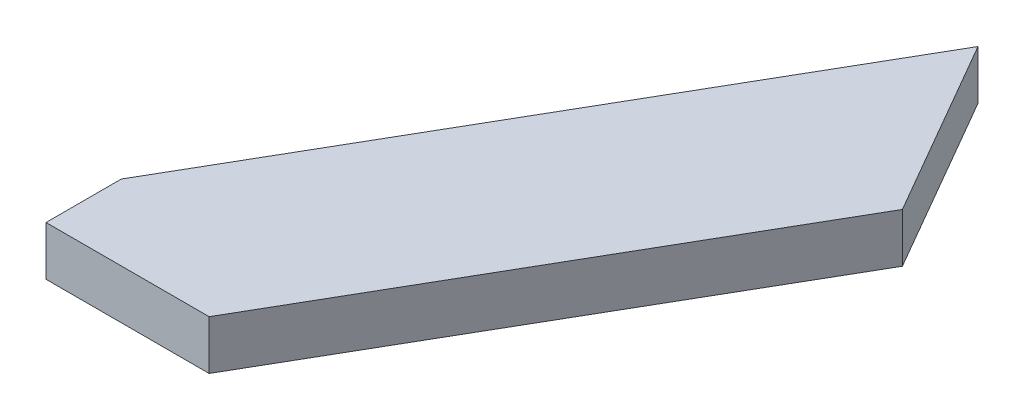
ISO-10303-21;
HEADER;
FILE_DESCRIPTION(('STEP AP214'),'2;1');
FILE_NAME('part.step','',(''),(''),'','','');
FILE_SCHEMA(('AUTOMOTIVE_DESIGN { 1 0 10303 214 1 1 1 1 }'));
ENDSEC;
DATA;
#1=APPLICATION_CONTEXT('core data for automotive mechanical design processes');
#2=APPLICATION_PROTOCOL_DEFINITION('international standard','automotive_design',2000,#1);
#3=PRODUCT_CONTEXT('',#1,'mechanical');
#4=PRODUCT('Part','Part','',(#3));
#5=PRODUCT_RELATED_PRODUCT_CATEGORY('part','',(#4));
#6=PRODUCT_DEFINITION_FORMATION('','',#4);
#7=PRODUCT_DEFINITION_CONTEXT('part definition',#1,'design');
#8=PRODUCT_DEFINITION('design','',#6,#7);
#9=PRODUCT_DEFINITION_SHAPE('','',#8);
#10=(LENGTH_UNIT() NAMED_UNIT(*) SI_UNIT(.MILLI.,.METRE.));
#11=(NAMED_UNIT(*) PLANE_ANGLE_UNIT() SI_UNIT($,.RADIAN.));
#12=(NAMED_UNIT(*) SI_UNIT($,.STERADIAN.) SOLID_ANGLE_UNIT());
#13=UNCERTAINTY_MEASURE_WITH_UNIT(LENGTH_MEASURE(1.E-05),#10,'distance_accuracy_value','');
#14=(GEOMETRIC_REPRESENTATION_CONTEXT(3) GLOBAL_UNCERTAINTY_ASSIGNED_CONTEXT((#13)) GLOBAL_UNIT_ASSIGNED_CONTEXT((#10,
#11,#12)) REPRESENTATION_CONTEXT('',''));
#15=CARTESIAN_POINT('',(0.,0.,0.));
#16=DIRECTION('',(0.,0.,1.));
#17=DIRECTION('',(1.,0.,0.));
#18=AXIS2_PLACEMENT_3D('',#15,#16,#17);
#19=CARTESIAN_POINT('',(-155.112278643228,17.4625,195.05795859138));
#20=DIRECTION('',(1.,0.,0.));
#21=DIRECTION('',(0.,0.,-1.));
#22=AXIS2_PLACEMENT_3D('',#19,#20,#21);
#23=PLANE('',#22);
#24=DIRECTION('',(0.,0.,1.));
#25=VECTOR('',#24,1.);
#26=CARTESIAN_POINT('',(-155.112278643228,-17.4625,195.05795859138));
#27=LINE('',#26,#25);
#28=CARTESIAN_POINT('',(-155.112278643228,-17.4625,141.662347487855));
#29=VERTEX_POINT('',#28);
#30=CARTESIAN_POINT('',(-155.112278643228,-17.4625,195.05795859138));
#31=VERTEX_POINT('',#30);
#32=EDGE_CURVE('E121',#29,#31,#27,.T.);
#33=ORIENTED_EDGE('',*,*,#32,.T.);
#34=DIRECTION('',(0.,-1.,0.));
#35=VECTOR('',#34,1.);
#36=CARTESIAN_POINT('',(-155.112278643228,17.4625,195.05795859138));
#37=LINE('',#36,#35);
#38=CARTESIAN_POINT('',(-155.112278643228,17.4625,195.05795859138));
#39=VERTEX_POINT('',#38);
#40=EDGE_CURVE('E11',#39,#31,#37,.T.);
#41=ORIENTED_EDGE('',*,*,#40,.F.);
#42=DIRECTION('',(0.,0.,1.));
#43=VECTOR('',#42,1.);
#44=CARTESIAN_POINT('',(-155.112278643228,17.4625,195.05795859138));
#45=LINE('',#44,#43);
#46=CARTESIAN_POINT('',(-155.112278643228,17.4625,141.662347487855));
#47=VERTEX_POINT('',#46);
#48=EDGE_CURVE('E139',#47,#39,#45,.T.);
#49=ORIENTED_EDGE('',*,*,#48,.F.);
#50=DIRECTION('',(0.,-1.,0.));
#51=VECTOR('',#50,1.);
#52=CARTESIAN_POINT('',(-155.112278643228,17.4625,141.662347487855));
#53=LINE('',#52,#51);
#54=EDGE_CURVE('E119',#47,#29,#53,.T.);
#55=ORIENTED_EDGE('',*,*,#54,.T.);
#56=EDGE_LOOP('',(#33,#41,#49,#55));
#57=FACE_BOUND('',#56,.T.);
#58=ADVANCED_FACE('F44',(#57),#23,.F.);
#59=CARTESIAN_POINT('',(-39.2932807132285,17.4625,195.05795859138));
#60=DIRECTION('',(0.,0.,-1.));
#61=DIRECTION('',(-1.,0.,0.));
#62=AXIS2_PLACEMENT_3D('',#59,#60,#61);
#63=PLANE('',#62);
#64=DIRECTION('',(1.,0.,0.));
#65=VECTOR('',#64,1.);
#66=CARTESIAN_POINT('',(-39.2932807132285,-17.4625,195.05795859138));
#67=LINE('',#66,#65);
#68=CARTESIAN_POINT('',(-39.2932807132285,-17.4625,195.05795859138));
#69=VERTEX_POINT('',#68);
#70=EDGE_CURVE('E129',#31,#69,#67,.T.);
#71=ORIENTED_EDGE('',*,*,#70,.T.);
#72=DIRECTION('',(0.,-1.,0.));
#73=VECTOR('',#72,1.);
#74=CARTESIAN_POINT('',(-39.2932807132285,17.4625,195.05795859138));
#75=LINE('',#74,#73);
#76=CARTESIAN_POINT('',(-39.2932807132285,17.4625,195.05795859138));
#77=VERTEX_POINT('',#76);
#78=EDGE_CURVE('E53',#77,#69,#75,.T.);
#79=ORIENTED_EDGE('',*,*,#78,.F.);
#80=DIRECTION('',(1.,0.,0.));
#81=VECTOR('',#80,1.);
#82=CARTESIAN_POINT('',(-39.2932807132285,17.4625,195.05795859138));
#83=LINE('',#82,#81);
#84=EDGE_CURVE('E98',#39,#77,#83,.T.);
#85=ORIENTED_EDGE('',*,*,#84,.F.);
#86=ORIENTED_EDGE('',*,*,#40,.T.);
#87=EDGE_LOOP('',(#71,#79,#85,#86));
#88=FACE_BOUND('',#87,.T.);
#89=ADVANCED_FACE('F160',(#88),#63,.F.);
#90=CARTESIAN_POINT('',(-39.2932807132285,17.4625,195.05795859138));
#91=DIRECTION('',(-0.866025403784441,0.,-0.499999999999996));
#92=DIRECTION('',(-0.499999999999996,0.,0.866025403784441));
#93=AXIS2_PLACEMENT_3D('',#90,#91,#92);
#94=PLANE('',#93);
#95=DIRECTION('',(0.499999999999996,0.,-0.866025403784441));
#96=VECTOR('',#95,1.);
#97=CARTESIAN_POINT('',(-39.2932807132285,-17.4625,195.05795859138));
#98=LINE('',#97,#96);
#99=CARTESIAN_POINT('',(140.832123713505,-17.4625,-116.928393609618));
#100=VERTEX_POINT('',#99);
#101=EDGE_CURVE('E115',#69,#100,#98,.T.);
#102=ORIENTED_EDGE('',*,*,#101,.T.);
#103=DIRECTION('',(0.,-1.,0.));
#104=VECTOR('',#103,1.);
#105=CARTESIAN_POINT('',(140.832123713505,17.4625,-116.928393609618));
#106=LINE('',#105,#104);
#107=CARTESIAN_POINT('',(140.832123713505,17.4625,-116.928393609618));
#108=VERTEX_POINT('',#107);
#109=EDGE_CURVE('E107',#108,#100,#106,.T.);
#110=ORIENTED_EDGE('',*,*,#109,.F.);
#111=DIRECTION('',(0.499999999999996,0.,-0.866025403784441));
#112=VECTOR('',#111,1.);
#113=CARTESIAN_POINT('',(-39.2932807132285,17.4625,195.05795859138));
#114=LINE('',#113,#112);
#115=EDGE_CURVE('E99',#77,#108,#114,.T.);
#116=ORIENTED_EDGE('',*,*,#115,.F.);
#117=ORIENTED_EDGE('',*,*,#78,.T.);
#118=EDGE_LOOP('',(#102,#110,#116,#117));
#119=FACE_BOUND('',#118,.T.);
#120=ADVANCED_FACE('F109',(#119),#94,.F.);
#121=CARTESIAN_POINT('',(67.5086384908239,17.4625,-243.928391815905));
#122=DIRECTION('',(-0.866025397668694,0.,0.50000001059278));
#123=DIRECTION('',(0.50000001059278,0.,0.866025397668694));
#124=AXIS2_PLACEMENT_3D('',#121,#122,#123);
#125=PLANE('',#124);
#126=DIRECTION('',(-0.50000001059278,0.,-0.866025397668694));
#127=VECTOR('',#126,1.);
#128=CARTESIAN_POINT('',(67.5086384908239,-17.4625,-243.928391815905));
#129=LINE('',#128,#127);
#130=CARTESIAN_POINT('',(67.5086384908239,-17.4625,-243.928391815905));
#131=VERTEX_POINT('',#130);
#132=EDGE_CURVE('E85',#100,#131,#129,.T.);
#133=ORIENTED_EDGE('',*,*,#132,.T.);
#134=DIRECTION('',(0.,-1.,0.));
#135=VECTOR('',#134,1.);
#136=CARTESIAN_POINT('',(67.5086384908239,17.4625,-243.928391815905));
#137=LINE('',#136,#135);
#138=CARTESIAN_POINT('',(67.5086384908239,17.4625,-243.928391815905));
#139=VERTEX_POINT('',#138);
#140=EDGE_CURVE('E112',#139,#131,#137,.T.);
#141=ORIENTED_EDGE('',*,*,#140,.F.);
#142=DIRECTION('',(-0.50000001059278,0.,-0.866025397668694));
#143=VECTOR('',#142,1.);
#144=CARTESIAN_POINT('',(67.5086384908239,17.4625,-243.928391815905));
#145=LINE('',#144,#143);
#146=EDGE_CURVE('E104',#108,#139,#145,.T.);
#147=ORIENTED_EDGE('',*,*,#146,.F.);
#148=ORIENTED_EDGE('',*,*,#109,.T.);
#149=EDGE_LOOP('',(#133,#141,#147,#148));
#150=FACE_BOUND('',#149,.T.);
#151=ADVANCED_FACE('F116',(#150),#125,.F.);
#152=CARTESIAN_POINT('',(-155.112278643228,17.4625,141.662347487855));
#153=DIRECTION('',(0.866025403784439,0.,0.5));
#154=DIRECTION('',(0.5,0.,-0.866025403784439));
#155=AXIS2_PLACEMENT_3D('',#152,#153,#154);
#156=PLANE('',#155);
#157=DIRECTION('',(-0.5,0.,0.866025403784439));
#158=VECTOR('',#157,1.);
#159=CARTESIAN_POINT('',(-155.112278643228,-17.4625,141.662347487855));
#160=LINE('',#159,#158);
#161=EDGE_CURVE('E86',#131,#29,#160,.T.);
#162=ORIENTED_EDGE('',*,*,#161,.T.);
#163=ORIENTED_EDGE('',*,*,#54,.F.);
#164=DIRECTION('',(-0.5,0.,0.866025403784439));
#165=VECTOR('',#164,1.);
#166=CARTESIAN_POINT('',(-155.112278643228,17.4625,141.662347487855));
#167=LINE('',#166,#165);
#168=EDGE_CURVE('E65',#139,#47,#167,.T.);
#169=ORIENTED_EDGE('',*,*,#168,.F.);
#170=ORIENTED_EDGE('',*,*,#140,.T.);
#171=EDGE_LOOP('',(#162,#163,#169,#170));
#172=FACE_BOUND('',#171,.T.);
#173=ADVANCED_FACE('F149',(#172),#156,.F.);
#174=CARTESIAN_POINT('',(0.,17.4625,0.));
#175=DIRECTION('',(0.,1.,0.));
#176=DIRECTION('',(0.,0.,1.));
#177=AXIS2_PLACEMENT_3D('',#174,#175,#176);
#178=PLANE('',#177);
#179=ORIENTED_EDGE('',*,*,#48,.T.);
#180=ORIENTED_EDGE('',*,*,#84,.T.);
#181=ORIENTED_EDGE('',*,*,#115,.T.);
#182=ORIENTED_EDGE('',*,*,#146,.T.);
#183=ORIENTED_EDGE('',*,*,#168,.T.);
#184=EDGE_LOOP('',(#179,#180,#181,#182,#183));
#185=FACE_BOUND('',#184,.T.);
#186=ADVANCED_FACE('F105',(#185),#178,.T.);
#187=CARTESIAN_POINT('',(0.,-17.4625,0.));
#188=DIRECTION('',(0.,1.,0.));
#189=DIRECTION('',(0.,0.,1.));
#190=AXIS2_PLACEMENT_3D('',#187,#188,#189);
#191=PLANE('',#190);
#192=ORIENTED_EDGE('',*,*,#32,.F.);
#193=ORIENTED_EDGE('',*,*,#161,.F.);
#194=ORIENTED_EDGE('',*,*,#132,.F.);
#195=ORIENTED_EDGE('',*,*,#101,.F.);
#196=ORIENTED_EDGE('',*,*,#70,.F.);
#197=EDGE_LOOP('',(#192,#193,#194,#195,#196));
#198=FACE_BOUND('',#197,.T.);
#199=ADVANCED_FACE('F144',(#198),#191,.F.);
#200=CLOSED_SHELL('',(#58,#89,#120,#151,#173,#186,#199));
#201=MANIFOLD_SOLID_BREP('B2',#200);
#202=ADVANCED_BREP_SHAPE_REPRESENTATION('',(#18,#201),#14);
#203=SHAPE_DEFINITION_REPRESENTATION(#9,#202);
ENDSEC;
END-ISO-10303-21;
